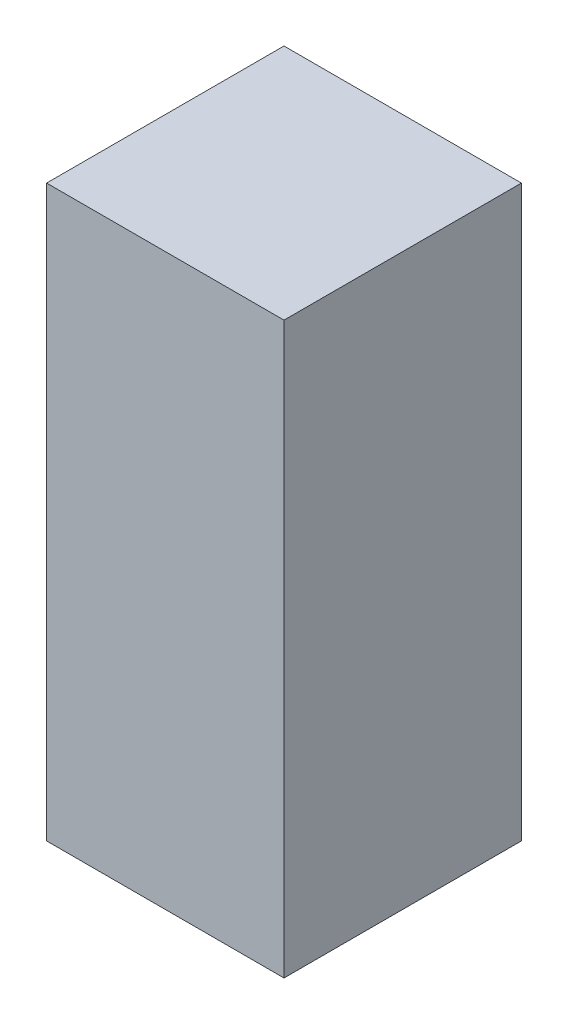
from build123d import *

# Parameters (mm, degrees)
SKETCH1_W      = 50
SKETCH1_H      = 50
EXTRUDE1_DEPTH = 120


with BuildPart() as part:
    # Sketch1 → Extrude1 (new body)
    with BuildSketch(Plane(origin=(0, 0, 0), x_dir=(1, 0, 0), z_dir=(0, 1, 0))):
        Rectangle(SKETCH1_W, SKETCH1_H)
    extrude(amount=EXTRUDE1_DEPTH)


solid = part.part
